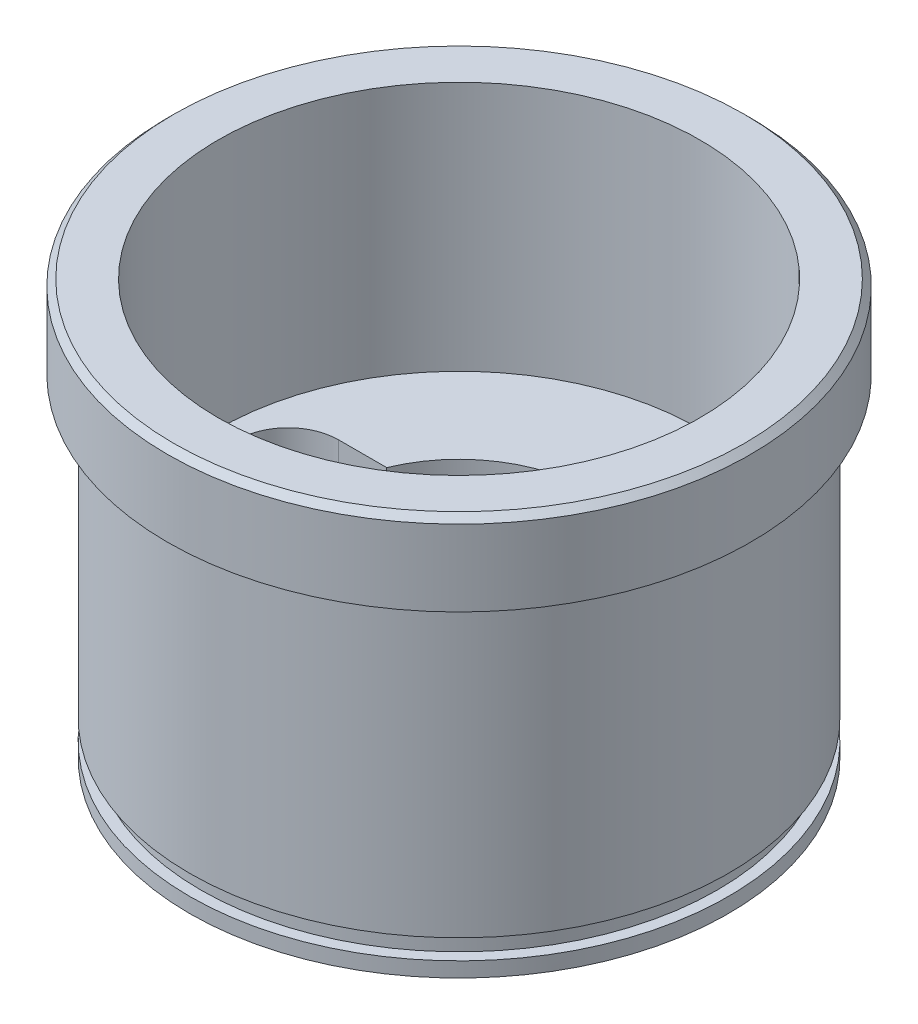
from build123d import *

# Parameters (mm, degrees)
CHANFREIN1_SIZE              = 1
CHANFREIN2_SIZE              = 1
CHANFREIN3_SIZE              = 1.5
CHANFREIN3_SIZE2             = 0.866025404
ESQUISSE4_W                  = 12.671296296
ESQUISSE4_H                  = 3.15
ENL_V_MAT_EXTRU_1_DEPTH      = 7
ENL_V_MAT_EXTRU_2_REACH      = 81.964
ESQUISSE6_R                  = 3.5
R_P_TITION_CIRCULAIRE1_COUNT = 3


with BuildPart() as part:
    # Esquisse2 → R_volution1 (revolve)
    with BuildSketch(Plane.XY, mode=Mode.PRIVATE) as r_volution1_sk:
        Polygon((-42.5, 52.5), (-42.5, 0), (-33, 0), (-33, 14), (-21, 14), (-21, 26), (-38, 26), (-38, 65.5), (-46, 65.5), (-46, 52.5), align=None)
    revolve(r_volution1_sk.sketch.rotate(Axis((0, 0, 0), (0, -1, 0)), 270), axis=Axis((0, 0, 0), (0, -1, 0)))

    # Chanfrein1
    chanfrein1_edges = [part.edges().sort_by_distance(p)[0] for p in [
        (0, 65.5, -46),
    ]]
    chamfer(chanfrein1_edges, length=CHANFREIN1_SIZE)

    # Chanfrein2
    chanfrein2_edges = [part.edges().sort_by_distance(p)[0] for p in [
        (0, 14, -21),
    ]]
    chamfer(chanfrein2_edges, length=CHANFREIN2_SIZE)

    # Chanfrein3
    chanfrein3_edges = [part.edges().sort_by_distance(p)[0] for p in [
        (0, 0, -33),
    ]]
    chanfrein3_side = [part.faces().sort_by_distance(p)[0] for p in [
        (0, 7, -33),
    ]]
    chamfer(chanfrein3_edges, length=CHANFREIN3_SIZE, length2=CHANFREIN3_SIZE2, reference=chanfrein3_side[0])

    # Esquisse3 → Enl_vement de mati_re-R_volution1 (revolve, cut)
    with BuildSketch(Plane.XY, mode=Mode.PRIVATE) as enl_vement_de_mati_re_r_volution1_sk:
        with BuildLine():
            Line((-34.86, 9.77), (0, 9.77))
            Line((0, 9.77), (0, 5))
            Line((0, 5), (-34.86, 5))
            ThreePointArc((-34.86, 5), (-35.567106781, 5.292893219), (-35.86, 6))
            Line((-35.86, 6), (-35.86, 8.77))
            ThreePointArc((-35.86, 8.77), (-35.567106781, 9.477106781), (-34.86, 9.77))
        make_face()
    revolve(enl_vement_de_mati_re_r_volution1_sk.sketch.rotate(Axis((0, 0, 0), (0, 1, 0)), 270), axis=Axis((0, 0, 0), (0, 1, 0)), mode=Mode.SUBTRACT)

    # Esquisse4 → Enl_vement de mati_re-R_volution2 (revolve, cut)
    with BuildSketch(Plane.XY, mode=Mode.PRIVATE) as enl_vement_de_mati_re_r_volution2_sk:
        with Locations((-47.085648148, 3.925)):
            Rectangle(ESQUISSE4_W, ESQUISSE4_H)
    revolve(enl_vement_de_mati_re_r_volution2_sk.sketch.rotate(Axis((0, 0, 0), (0, -1, 0)), 270), axis=Axis((0, 0, 0), (0, -1, 0)), mode=Mode.SUBTRACT)

    # Esquisse5 → Enl_v. mat.-Extru.1 (cut)
    with BuildSketch(Plane(origin=(0, 26, 0), x_dir=(-1, 0, 0), z_dir=(0, 1, 0))):
        with BuildLine():
            Line((27, -8), (0, -8))
            Line((0, -8), (0, 8))
            Line((0, 8), (27, 8))
            ThreePointArc((27, 8), (35, 0), (27, -8))
        make_face()
    enl_v_mat_extru_1 = extrude(amount=-ENL_V_MAT_EXTRU_1_DEPTH, mode=Mode.SUBTRACT)

    # Esquisse6 → Enl_v. mat.-Extru.2 (cut, up to next)
    with BuildSketch(Plane(origin=(0, 19, 0), x_dir=(-1, 0, 0), z_dir=(0, 1, 0)), mode=Mode.PRIVATE) as enl_v_mat_extru_2_sk1:
        with Locations(Location((27, 0, 0), (0, 0, 90))):
            Circle(ESQUISSE6_R)
    enl_v_mat_extru_2_tool1 = extrude(enl_v_mat_extru_2_sk1.sketch, amount=-ENL_V_MAT_EXTRU_2_REACH, mode=Mode.PRIVATE) & part.part
    enl_v_mat_extru_2 = enl_v_mat_extru_2_tool1.solids().sort_by_distance((-27, 19, 0))[0]
    add(enl_v_mat_extru_2, mode=Mode.SUBTRACT)

    # R_p_tition circulaire1: Enl_v. mat.-Extru.1, Enl_v. mat.-Extru.2 ×3 about axis
    r_p_tition_circulaire1_axis = Axis((0, 0, 0), (0, 1, 0))
    add([enl_v_mat_extru_1.rotate(r_p_tition_circulaire1_axis, i * 360 / R_P_TITION_CIRCULAIRE1_COUNT) for i in range(1, R_P_TITION_CIRCULAIRE1_COUNT)], mode=Mode.SUBTRACT)
    add([enl_v_mat_extru_2.rotate(r_p_tition_circulaire1_axis, i * 360 / R_P_TITION_CIRCULAIRE1_COUNT) for i in range(1, R_P_TITION_CIRCULAIRE1_COUNT)], mode=Mode.SUBTRACT)


solid = part.part
